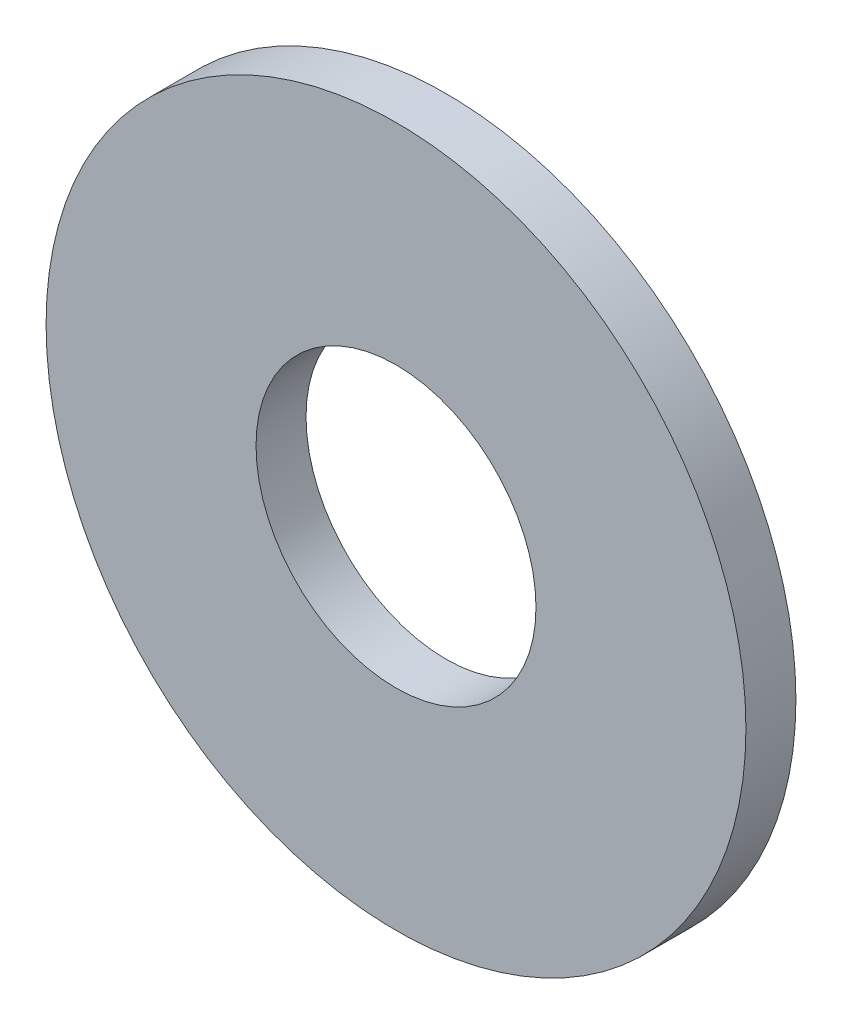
ISO-10303-21;
HEADER;
FILE_DESCRIPTION(('STEP AP214'),'2;1');
FILE_NAME('part.step','',(''),(''),'','','');
FILE_SCHEMA(('AUTOMOTIVE_DESIGN { 1 0 10303 214 1 1 1 1 }'));
ENDSEC;
DATA;
#1=APPLICATION_CONTEXT('core data for automotive mechanical design processes');
#2=APPLICATION_PROTOCOL_DEFINITION('international standard','automotive_design',2000,#1);
#3=PRODUCT_CONTEXT('',#1,'mechanical');
#4=PRODUCT('Part','Part','',(#3));
#5=PRODUCT_RELATED_PRODUCT_CATEGORY('part','',(#4));
#6=PRODUCT_DEFINITION_FORMATION('','',#4);
#7=PRODUCT_DEFINITION_CONTEXT('part definition',#1,'design');
#8=PRODUCT_DEFINITION('design','',#6,#7);
#9=PRODUCT_DEFINITION_SHAPE('','',#8);
#10=(LENGTH_UNIT() NAMED_UNIT(*) SI_UNIT(.MILLI.,.METRE.));
#11=(NAMED_UNIT(*) PLANE_ANGLE_UNIT() SI_UNIT($,.RADIAN.));
#12=(NAMED_UNIT(*) SI_UNIT($,.STERADIAN.) SOLID_ANGLE_UNIT());
#13=UNCERTAINTY_MEASURE_WITH_UNIT(LENGTH_MEASURE(1.E-05),#10,'distance_accuracy_value','');
#14=(GEOMETRIC_REPRESENTATION_CONTEXT(3) GLOBAL_UNCERTAINTY_ASSIGNED_CONTEXT((#13)) GLOBAL_UNIT_ASSIGNED_CONTEXT((#10,
#11,#12)) REPRESENTATION_CONTEXT('',''));
#15=CARTESIAN_POINT('',(0.,0.,0.));
#16=DIRECTION('',(0.,0.,1.));
#17=DIRECTION('',(1.,0.,0.));
#18=AXIS2_PLACEMENT_3D('',#15,#16,#17);
#19=CARTESIAN_POINT('',(0.,0.,2.5));
#20=DIRECTION('',(0.,0.,-1.));
#21=DIRECTION('',(-1.,0.,0.));
#22=AXIS2_PLACEMENT_3D('',#19,#20,#21);
#23=CYLINDRICAL_SURFACE('',#22,7.);
#24=CARTESIAN_POINT('',(0.,0.,2.5));
#25=DIRECTION('',(0.,0.,-1.));
#26=DIRECTION('',(1.,0.,0.));
#27=AXIS2_PLACEMENT_3D('',#24,#25,#26);
#28=CIRCLE('',#27,7.);
#29=CARTESIAN_POINT('',(7.,0.,2.5));
#30=VERTEX_POINT('',#29);
#31=EDGE_CURVE('E10',#30,#30,#28,.T.);
#32=ORIENTED_EDGE('',*,*,#31,.F.);
#33=EDGE_LOOP('',(#32));
#34=FACE_BOUND('',#33,.T.);
#35=CARTESIAN_POINT('',(0.,0.,0.));
#36=DIRECTION('',(0.,0.,-1.));
#37=DIRECTION('',(1.,0.,0.));
#38=AXIS2_PLACEMENT_3D('',#35,#36,#37);
#39=CIRCLE('',#38,7.);
#40=CARTESIAN_POINT('',(7.,0.,0.));
#41=VERTEX_POINT('',#40);
#42=EDGE_CURVE('E26',#41,#41,#39,.T.);
#43=ORIENTED_EDGE('',*,*,#42,.T.);
#44=EDGE_LOOP('',(#43));
#45=FACE_BOUND('',#44,.T.);
#46=ADVANCED_FACE('F15',(#34,#45),#23,.F.);
#47=CARTESIAN_POINT('',(0.,0.,2.5));
#48=DIRECTION('',(0.,0.,-1.));
#49=DIRECTION('',(-1.,0.,0.));
#50=AXIS2_PLACEMENT_3D('',#47,#48,#49);
#51=CYLINDRICAL_SURFACE('',#50,17.5);
#52=CARTESIAN_POINT('',(0.,0.,2.5));
#53=DIRECTION('',(0.,0.,-1.));
#54=DIRECTION('',(1.,0.,0.));
#55=AXIS2_PLACEMENT_3D('',#52,#53,#54);
#56=CIRCLE('',#55,17.5);
#57=CARTESIAN_POINT('',(17.5,0.,2.5));
#58=VERTEX_POINT('',#57);
#59=EDGE_CURVE('E22',#58,#58,#56,.T.);
#60=ORIENTED_EDGE('',*,*,#59,.T.);
#61=EDGE_LOOP('',(#60));
#62=FACE_BOUND('',#61,.T.);
#63=CARTESIAN_POINT('',(0.,0.,0.));
#64=DIRECTION('',(0.,0.,-1.));
#65=DIRECTION('',(1.,0.,0.));
#66=AXIS2_PLACEMENT_3D('',#63,#64,#65);
#67=CIRCLE('',#66,17.5);
#68=CARTESIAN_POINT('',(17.5,0.,0.));
#69=VERTEX_POINT('',#68);
#70=EDGE_CURVE('E31',#69,#69,#67,.T.);
#71=ORIENTED_EDGE('',*,*,#70,.F.);
#72=EDGE_LOOP('',(#71));
#73=FACE_BOUND('',#72,.T.);
#74=ADVANCED_FACE('F17',(#62,#73),#51,.T.);
#75=CARTESIAN_POINT('',(0.,0.,2.5));
#76=DIRECTION('',(0.,0.,-1.));
#77=DIRECTION('',(-1.,0.,0.));
#78=AXIS2_PLACEMENT_3D('',#75,#76,#77);
#79=PLANE('',#78);
#80=ORIENTED_EDGE('',*,*,#31,.T.);
#81=EDGE_LOOP('',(#80));
#82=FACE_BOUND('',#81,.T.);
#83=ORIENTED_EDGE('',*,*,#59,.F.);
#84=EDGE_LOOP('',(#83));
#85=FACE_BOUND('',#84,.T.);
#86=ADVANCED_FACE('F43',(#82,#85),#79,.F.);
#87=CARTESIAN_POINT('',(0.,0.,0.));
#88=DIRECTION('',(0.,0.,-1.));
#89=DIRECTION('',(-1.,0.,0.));
#90=AXIS2_PLACEMENT_3D('',#87,#88,#89);
#91=PLANE('',#90);
#92=ORIENTED_EDGE('',*,*,#42,.F.);
#93=EDGE_LOOP('',(#92));
#94=FACE_BOUND('',#93,.T.);
#95=ORIENTED_EDGE('',*,*,#70,.T.);
#96=EDGE_LOOP('',(#95));
#97=FACE_BOUND('',#96,.T.);
#98=ADVANCED_FACE('F40',(#94,#97),#91,.T.);
#99=CLOSED_SHELL('',(#46,#74,#86,#98));
#100=MANIFOLD_SOLID_BREP('B1',#99);
#101=ADVANCED_BREP_SHAPE_REPRESENTATION('',(#18,#100),#14);
#102=SHAPE_DEFINITION_REPRESENTATION(#9,#101);
ENDSEC;
END-ISO-10303-21;
